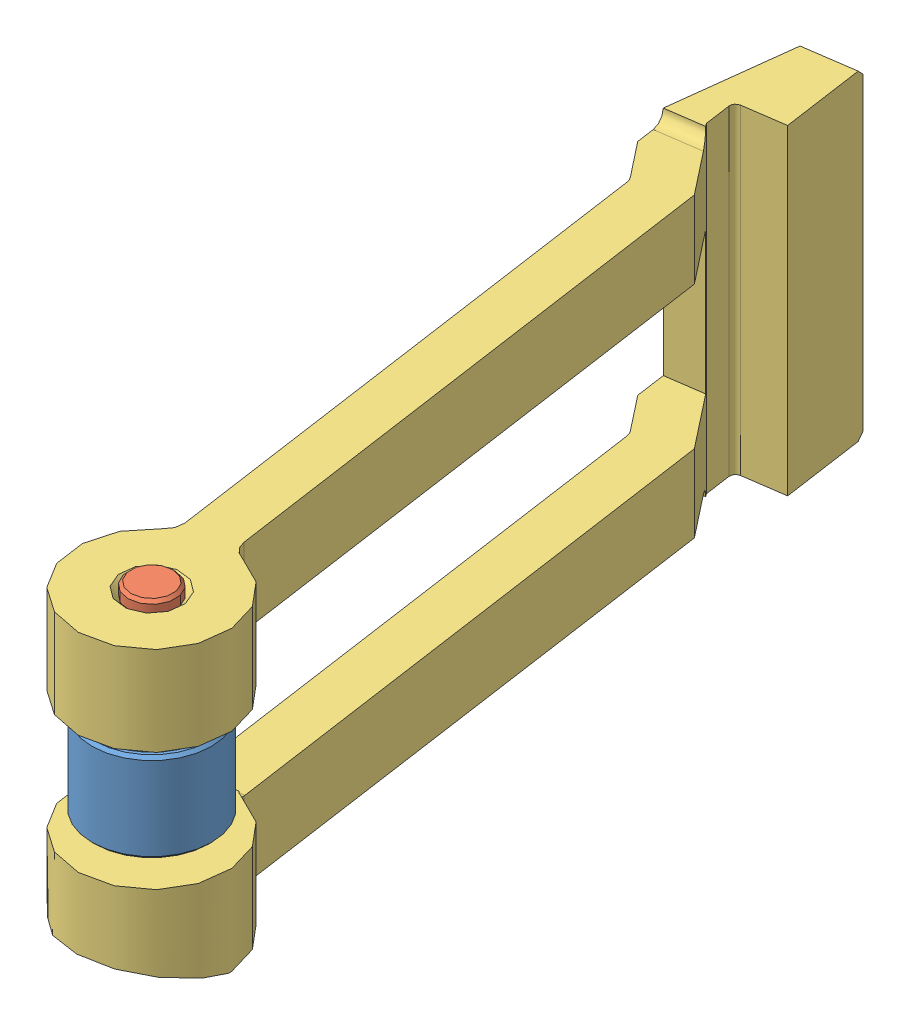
SolidWorks assembly CE-Butee.sldasm, configuration Défaut (file format 3100). Lengths in mm.
Overall size (45.81 54 150.15).
4 component instances, 3 part files, 1 mates.
Components (placement in the parent):
- Axe butee-1: Axe butee.SLDASM [Défaut] at (0.0746 0.182 0) size (20.1 52 20.1)
  - VIG-7-02 Silent Bloc-1: VIG-7-02 Silent Bloc.SLDPRT [Défaut] at origin size (20.1 19 20.1)
  - VIG-7-01 Axe de butee-1: VIG-7-01 Axe de butee.SLDPRT [Défaut] at origin size (8 52 8)
- VIG-8-01 Butee escamotable-1: VIG-8-01 Butee escamotable.sldprt [Défaut] at (0.0746 -26.9 0) x (0.989835 0 -0.142218) z (0 1 0) size (25 148.1 54)
Mates (geometry in assembly coordinates):
- Coaxiale1: concentric anti-aligned: cylinder of Axe butee-1/VIG-7-01 Axe de butee-1; cylinder of VIG-8-01 Butee escamotable-1
